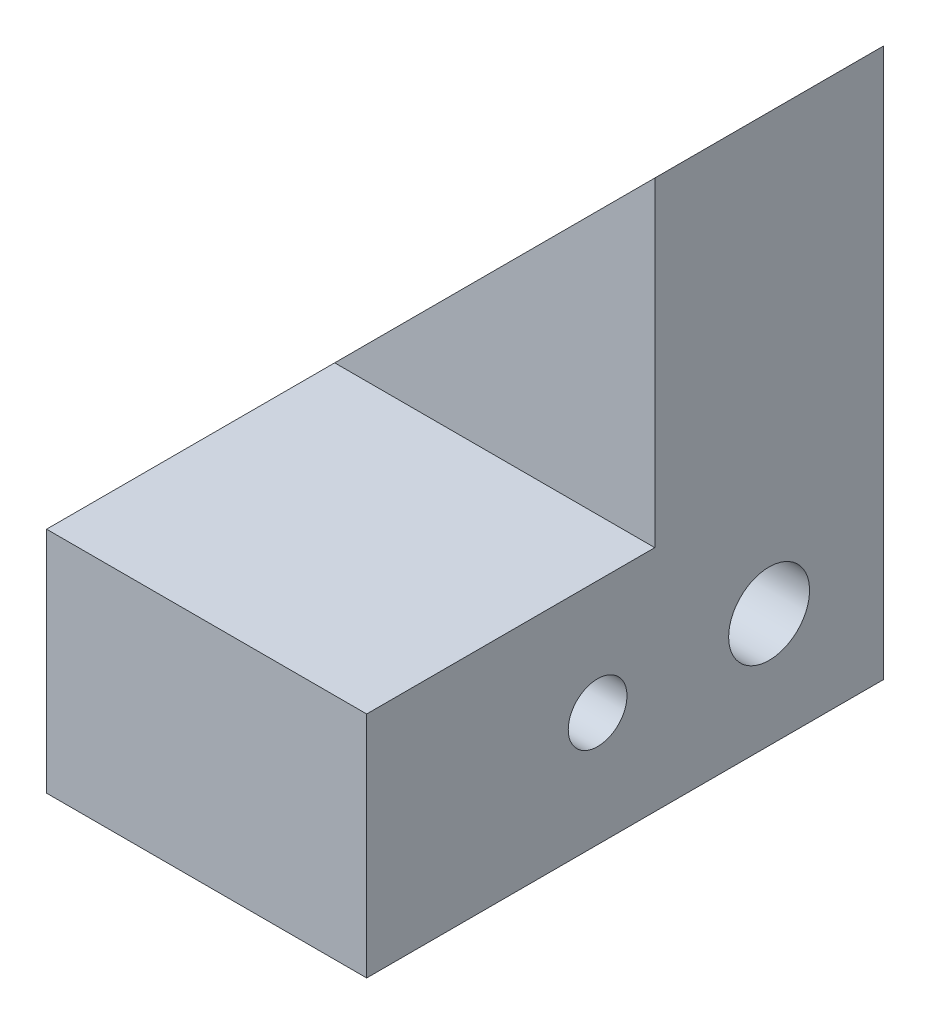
from build123d import *

# Parameters (mm, degrees)
SKETCH1_W                    = 17.78
SKETCH1_H                    = 28.702
BOSS_EXTRUDE1_DEPTH          = 30.48
SKETCH2_W                    = 16.002
SKETCH2_H                    = 17.78
CUT_EXTRUDE1_DEPTH           = 30.48
CUT_EXTRUDE2_DEPTH           = 30.48
F_30_0_1285_DIAMETER_HOLE1_D = 3.2639
F_16_0_177_DIAMETER_HOLE1_D  = 4.4958


with BuildPart() as part:
    # Sketch1 → Boss-Extrude1 (new body)
    with BuildSketch(Plane(origin=(0, 0, 0), x_dir=(1, 0, 0), z_dir=(0, 1, 0))):
        with Locations((-21.564816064, 2.202837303)):
            Rectangle(SKETCH1_W, SKETCH1_H)
    extrude(amount=BOSS_EXTRUDE1_DEPTH)

    # Sketch2 → Cut-Extrude1 (cut)
    with BuildSketch(Plane.ZY.offset(30.454816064)):
        with Locations((4.147162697, 21.59)):
            Rectangle(SKETCH2_W, SKETCH2_H)
    extrude(amount=-CUT_EXTRUDE1_DEPTH, mode=Mode.SUBTRACT)

    # Sketch3 → Cut-Extrude2 (cut)
    with BuildSketch(Plane.XY.offset(-3.853837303)):
        Polygon((-30.454816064, 30.48), (-30.454816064, 12.7), (-12.674816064, 30.48), align=None)
    extrude(amount=-CUT_EXTRUDE2_DEPTH, mode=Mode.SUBTRACT)

    # 30 _0.1285_ Diameter Hole1 (through all)
    with Locations(Plane.ZY.offset(30.454816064)):
        with Locations((-0.678837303, 6.35)):
            Hole(F_30_0_1285_DIAMETER_HOLE1_D / 2)

    # 16 _0.177_ Diameter Hole1 (through all)
    with Locations(Plane.ZY.offset(30.454816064)):
        with Locations((-10.203837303, 6.35)):
            Hole(F_16_0_177_DIAMETER_HOLE1_D / 2)


solid = part.part
